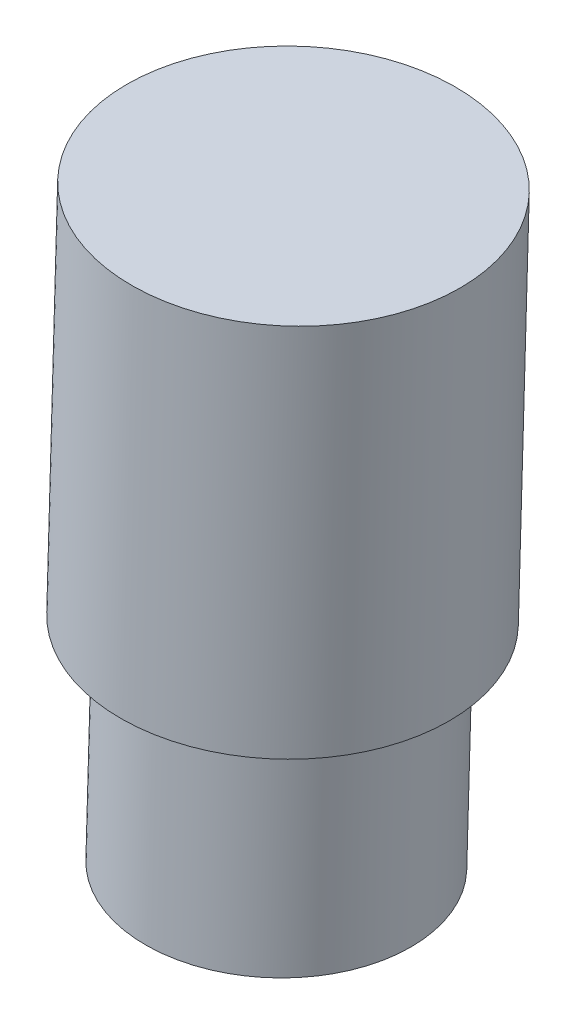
ISO-10303-21;
HEADER;
FILE_DESCRIPTION(('STEP AP214'),'2;1');
FILE_NAME('part.step','',(''),(''),'','','');
FILE_SCHEMA(('AUTOMOTIVE_DESIGN { 1 0 10303 214 1 1 1 1 }'));
ENDSEC;
DATA;
#1=APPLICATION_CONTEXT('core data for automotive mechanical design processes');
#2=APPLICATION_PROTOCOL_DEFINITION('international standard','automotive_design',2000,#1);
#3=PRODUCT_CONTEXT('',#1,'mechanical');
#4=PRODUCT('Part','Part','',(#3));
#5=PRODUCT_RELATED_PRODUCT_CATEGORY('part','',(#4));
#6=PRODUCT_DEFINITION_FORMATION('','',#4);
#7=PRODUCT_DEFINITION_CONTEXT('part definition',#1,'design');
#8=PRODUCT_DEFINITION('design','',#6,#7);
#9=PRODUCT_DEFINITION_SHAPE('','',#8);
#10=(LENGTH_UNIT() NAMED_UNIT(*) SI_UNIT(.MILLI.,.METRE.));
#11=(NAMED_UNIT(*) PLANE_ANGLE_UNIT() SI_UNIT($,.RADIAN.));
#12=(NAMED_UNIT(*) SI_UNIT($,.STERADIAN.) SOLID_ANGLE_UNIT());
#13=UNCERTAINTY_MEASURE_WITH_UNIT(LENGTH_MEASURE(1.E-05),#10,'distance_accuracy_value','');
#14=(GEOMETRIC_REPRESENTATION_CONTEXT(3) GLOBAL_UNCERTAINTY_ASSIGNED_CONTEXT((#13)) GLOBAL_UNIT_ASSIGNED_CONTEXT((#10,
#11,#12)) REPRESENTATION_CONTEXT('',''));
#15=CARTESIAN_POINT('',(0.,0.,0.));
#16=DIRECTION('',(0.,0.,1.));
#17=DIRECTION('',(1.,0.,0.));
#18=AXIS2_PLACEMENT_3D('',#15,#16,#17);
#19=CARTESIAN_POINT('',(-234.568156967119,3.59017791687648,-182.350120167));
#20=DIRECTION('',(0.028773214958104,0.999585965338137,0.));
#21=DIRECTION('',(-0.999585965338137,0.028773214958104,0.));
#22=AXIS2_PLACEMENT_3D('',#19,#20,#21);
#23=CYLINDRICAL_SURFACE('',#22,7.74730145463);
#24=CARTESIAN_POINT('',(-234.561745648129,3.81290813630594,-182.350120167));
#25=DIRECTION('',(0.028773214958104,0.999585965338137,0.));
#26=DIRECTION('',(-0.999585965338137,0.028773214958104,0.));
#27=AXIS2_PLACEMENT_3D('',#24,#25,#26);
#28=CIRCLE('',#27,7.74730145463);
#29=CARTESIAN_POINT('',(-242.305839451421,4.03582290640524,-182.350120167));
#30=VERTEX_POINT('',#29);
#31=EDGE_CURVE('E10',#30,#30,#28,.T.);
#32=ORIENTED_EDGE('',*,*,#31,.T.);
#33=EDGE_LOOP('',(#32));
#34=FACE_BOUND('',#33,.T.);
#35=CARTESIAN_POINT('',(-234.204372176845,16.2281181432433,-182.350120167));
#36=DIRECTION('',(0.028773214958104,0.999585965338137,0.));
#37=DIRECTION('',(-0.999585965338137,0.028773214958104,0.));
#38=AXIS2_PLACEMENT_3D('',#35,#36,#37);
#39=CIRCLE('',#38,7.74730145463);
#40=CARTESIAN_POINT('',(-241.948465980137,16.4510329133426,-182.350120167));
#41=VERTEX_POINT('',#40);
#42=EDGE_CURVE('E47',#41,#41,#39,.T.);
#43=ORIENTED_EDGE('',*,*,#42,.F.);
#44=EDGE_LOOP('',(#43));
#45=FACE_BOUND('',#44,.T.);
#46=ADVANCED_FACE('F33',(#34,#45),#23,.T.);
#47=CARTESIAN_POINT('',(-226.817651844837,3.58999336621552,-182.350120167));
#48=DIRECTION('',(-0.028773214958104,-0.999585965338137,0.));
#49=DIRECTION('',(0.999585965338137,-0.028773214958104,0.));
#50=AXIS2_PLACEMENT_3D('',#47,#48,#49);
#51=PLANE('',#50);
#52=ORIENTED_EDGE('',*,*,#31,.F.);
#53=EDGE_LOOP('',(#52));
#54=FACE_BOUND('',#53,.T.);
#55=ADVANCED_FACE('F57',(#54),#51,.T.);
#56=CARTESIAN_POINT('',(-233.574533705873,38.108804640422,-182.350120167));
#57=DIRECTION('',(0.028773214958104,0.999585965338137,0.));
#58=DIRECTION('',(-0.999585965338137,0.028773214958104,0.));
#59=AXIS2_PLACEMENT_3D('',#56,#57,#58);
#60=PLANE('',#59);
#61=CARTESIAN_POINT('',(-233.574533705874,38.1088046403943,-182.350120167));
#62=DIRECTION('',(0.028773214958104,0.999585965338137,0.));
#63=DIRECTION('',(-0.999585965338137,0.028773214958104,0.));
#64=AXIS2_PLACEMENT_3D('',#61,#62,#63);
#65=CIRCLE('',#64,9.59268424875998);
#66=CARTESIAN_POINT('',(-243.163246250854,38.384817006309,-182.350120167));
#67=VERTEX_POINT('',#66);
#68=EDGE_CURVE('E39',#67,#67,#65,.T.);
#69=ORIENTED_EDGE('',*,*,#68,.T.);
#70=EDGE_LOOP('',(#69));
#71=FACE_BOUND('',#70,.T.);
#72=ADVANCED_FACE('F61',(#71),#60,.T.);
#73=CARTESIAN_POINT('',(-234.568156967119,3.59017791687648,-182.350120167));
#74=DIRECTION('',(0.028773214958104,0.999585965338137,0.));
#75=DIRECTION('',(-0.999585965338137,0.028773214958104,0.));
#76=AXIS2_PLACEMENT_3D('',#73,#74,#75);
#77=CYLINDRICAL_SURFACE('',#76,9.59268424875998);
#78=CARTESIAN_POINT('',(-234.204372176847,16.2281181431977,-182.350120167));
#79=DIRECTION('',(0.028773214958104,0.999585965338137,0.));
#80=DIRECTION('',(-0.999585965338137,0.028773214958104,0.));
#81=AXIS2_PLACEMENT_3D('',#78,#79,#80);
#82=CIRCLE('',#81,9.59268424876);
#83=CARTESIAN_POINT('',(-243.793084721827,16.5041305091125,-182.350120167));
#84=VERTEX_POINT('',#83);
#85=EDGE_CURVE('E43',#84,#84,#82,.T.);
#86=ORIENTED_EDGE('',*,*,#85,.T.);
#87=EDGE_LOOP('',(#86));
#88=FACE_BOUND('',#87,.T.);
#89=ORIENTED_EDGE('',*,*,#68,.F.);
#90=EDGE_LOOP('',(#89));
#91=FACE_BOUND('',#90,.T.);
#92=ADVANCED_FACE('F66',(#88,#91),#77,.T.);
#93=CARTESIAN_POINT('',(-224.615659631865,15.9521057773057,-182.350120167));
#94=DIRECTION('',(-0.028773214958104,-0.999585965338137,0.));
#95=DIRECTION('',(0.999585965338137,-0.028773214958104,0.));
#96=AXIS2_PLACEMENT_3D('',#93,#94,#95);
#97=PLANE('',#96);
#98=ORIENTED_EDGE('',*,*,#42,.T.);
#99=EDGE_LOOP('',(#98));
#100=FACE_BOUND('',#99,.T.);
#101=ORIENTED_EDGE('',*,*,#85,.F.);
#102=EDGE_LOOP('',(#101));
#103=FACE_BOUND('',#102,.T.);
#104=ADVANCED_FACE('F53',(#100,#103),#97,.T.);
#105=CLOSED_SHELL('',(#46,#55,#72,#92,#104));
#106=MANIFOLD_SOLID_BREP('B2',#105);
#107=ADVANCED_BREP_SHAPE_REPRESENTATION('',(#18,#106),#14);
#108=SHAPE_DEFINITION_REPRESENTATION(#9,#107);
ENDSEC;
END-ISO-10303-21;
